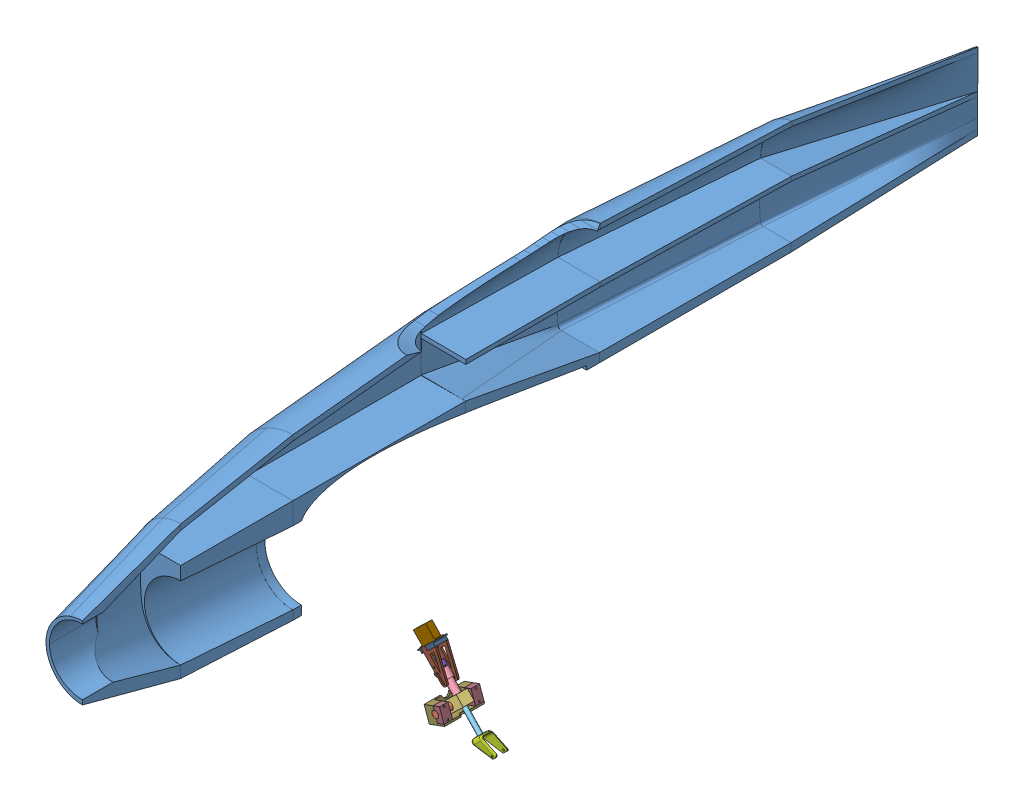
SolidWorks assembly fuse_roulette.SLDASM, configuration Défaut (file format 10000). Lengths in mm.
Overall size (316.35 243.54 1045.39).
16 component instances, 13 part files, 0 mates.
Components (placement in the parent):
- fuselagecomplet-1: fuselagecomplet.SLDPRT [Défaut] at (50.8901 -28.116 1568.0179) size (130.38 233.15 1045.39)
- Roulette_de_queue-2: Roulette_de_queue.SLDASM [Défaut] at (243.8099 -90.1036 1281.5045) size (103.51 103.6 46.8) (flexible)
  - axe_pivot-1: axe_pivot.SLDPRT [Défaut] at (2.8247 -0.4958 23.4) size (7.6 7.6 46.8)
  - sup_axe_jambe-1: sup_axe_jambe.SLDPRT [Défaut] at (2.8247 -0.4958 46.8) x (0.721916 0.691981 0) z (0 0 1) size (22 12 13)
  - tube_bouchon-1: tube_bouchon.SLDPRT [Défaut] at (-11.7834 27.7505 46.8) x (0 0 1) z (0.691981 -0.721916 0) size (10.4 19.15 36.5)
  - jambe-1: jambe.SLDPRT [Défaut] at (32.0089 -17.9363 46.8) x (0.2679 0.256791 0.928595) z (-0.691981 0.721916 0) size (5 5 32.5)
  - sup_palomier-1: sup_palomier.SLDPRT [Défaut] at (-17.4677 33.6807 46.8) x (-0.084747 -0.081233 -0.993086) z (0.691981 -0.721916 0) size (3.9 3.9 49.5)
  - sup_roue-2: sup_roue.SLDPRT [Défaut] at (35.885 -27.4531 47.3593) x (-0.105463 -0.10109 -0.989272) z (0.354815 0.925514 -0.1324) size (17.67 27.4 12.56)
  - blocage-2: blocage.SLDPRT [Défaut] at (-16.0837 32.2368 46.8) x (0 0 -1) z (0.691981 -0.721916 0) size (10 10 5)
  - servo-1: servo.SLDPRT [Défaut] at (-28.094 66.4363 43.05) x (-0.721916 -0.691981 0) z (0 0 1) size (27.6 27 7.5)
  - sup_servo-1: sup_servo.SLDPRT [Défaut] at (-28.2333 66.5817 41.55) x (-0.721916 -0.691981 0) z (0 0 1) size (27.6 4.68 14.5)
  - guide-1: guide.SLDPRT [Défaut] at (-28.2333 66.5817 39.55) x (-0.721916 -0.691981 0) z (0 0 1) size (19 38 2)
  - guide-2: guide.SLDPRT [Défaut] at (-28.2297 66.5852 52.05) x (-0.721916 -0.691981 0) z (0 0 1) size (19 38 2)
  - sup_train-1: sup_train.SLDPRT [Défaut] at (-7.5251 -4.2214 46.8) x (0 0 -1) z (0.940896 0.338695 0) size (46.8 18 19)
  - bride-1: bride.SLDPRT [Défaut] at (10.3519 2.2138 83.6) x (0 0 1) z (-0.940896 -0.338695 0) size (10 16 8)
  - bride-2: bride.SLDPRT [Défaut] at (10.3519 2.2138 46.8) x (0 0 1) z (-0.940896 -0.338695 0) size (10 16 8)
